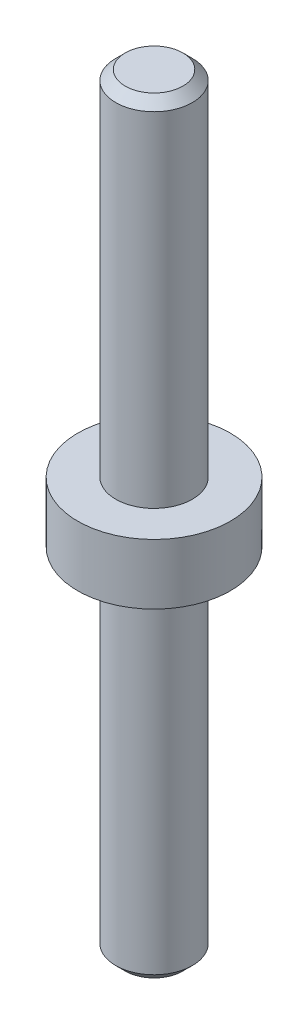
from build123d import *

# Parameters (mm, degrees)
SKETCH1_W     = 3.175
SKETCH1_H     = 31.75
CHAMFER1_SIZE = 0.7874
SKETCH2_W     = 3.15000005
SKETCH2_H     = 5


with BuildPart() as part:
    # Sketch1 → Revolve1 (revolve)
    with BuildSketch(Plane.XY, mode=Mode.PRIVATE) as revolve1_sk:
        with Locations((-1.5875, 15.875)):
            Rectangle(SKETCH1_W, SKETCH1_H)
    revolve(revolve1_sk.sketch.rotate(Axis((0, 31.75, 0), (0, 1, 0)), 270), axis=Axis((0, 31.75, 0), (0, 1, 0)))

    # Chamfer1
    chamfer1_edges = [part.edges().sort_by_distance(p)[0] for p in [
        (0, 31.75, 3.175),
    ]]
    chamfer(chamfer1_edges, length=CHAMFER1_SIZE)

    # Mirror1: part across plane


with BuildPart() as part_1:
    add(part.part)
    add(part.part.mirror(Plane(origin=(-3.175, 0, 0), x_dir=(0, 0, 1), z_dir=(0, 1, 0))))

    # Sketch2 → Revolve2 (revolve)
    with BuildSketch(Plane.XY, mode=Mode.PRIVATE) as revolve2_sk:
        with Locations((-4.750000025, 0)):
            Rectangle(SKETCH2_W, SKETCH2_H)
    revolve(revolve2_sk.sketch.rotate(Axis((0, 0, 0), (0, 1, 0)), 270), axis=Axis((0, 0, 0), (0, 1, 0)))


solid = part_1.part
